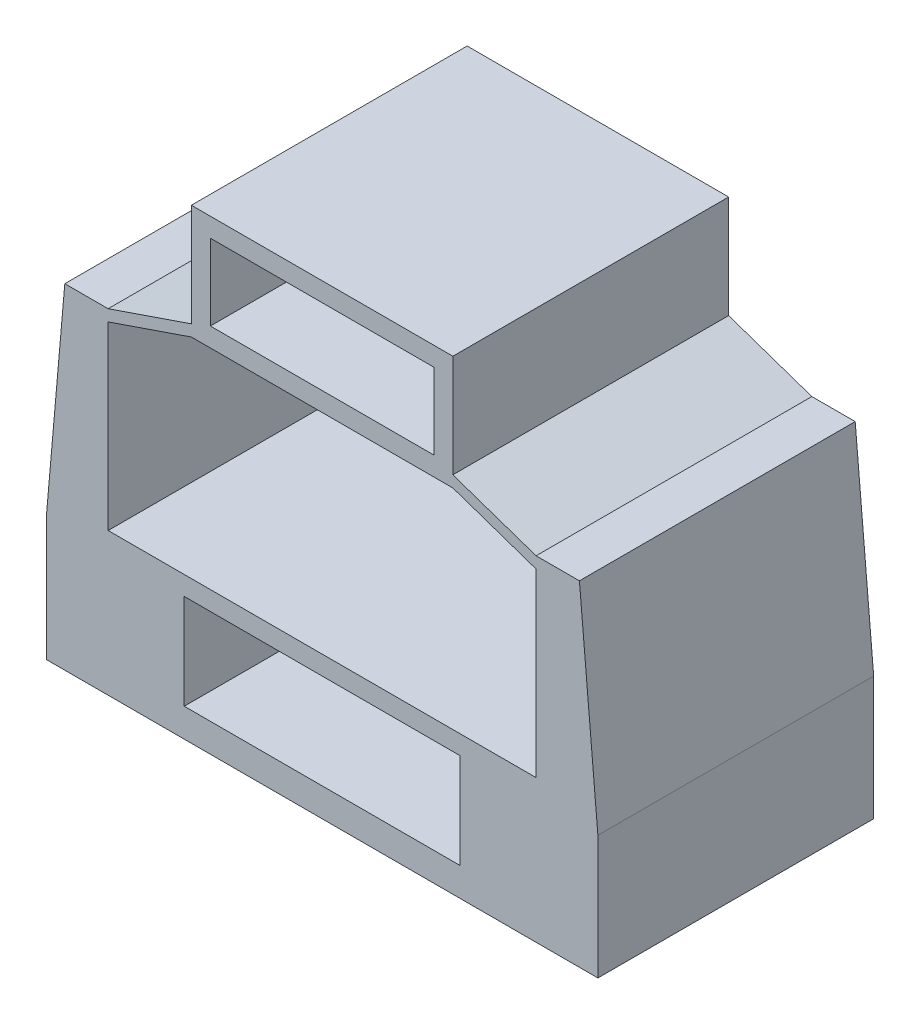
ISO-10303-21;
HEADER;
FILE_DESCRIPTION(('STEP AP214'),'2;1');
FILE_NAME('part.step','',(''),(''),'','','');
FILE_SCHEMA(('AUTOMOTIVE_DESIGN { 1 0 10303 214 1 1 1 1 }'));
ENDSEC;
DATA;
#1=APPLICATION_CONTEXT('core data for automotive mechanical design processes');
#2=APPLICATION_PROTOCOL_DEFINITION('international standard','automotive_design',2000,#1);
#3=PRODUCT_CONTEXT('',#1,'mechanical');
#4=PRODUCT('Part','Part','',(#3));
#5=PRODUCT_RELATED_PRODUCT_CATEGORY('part','',(#4));
#6=PRODUCT_DEFINITION_FORMATION('','',#4);
#7=PRODUCT_DEFINITION_CONTEXT('part definition',#1,'design');
#8=PRODUCT_DEFINITION('design','',#6,#7);
#9=PRODUCT_DEFINITION_SHAPE('','',#8);
#10=(LENGTH_UNIT() NAMED_UNIT(*) SI_UNIT(.MILLI.,.METRE.));
#11=(NAMED_UNIT(*) PLANE_ANGLE_UNIT() SI_UNIT($,.RADIAN.));
#12=(NAMED_UNIT(*) SI_UNIT($,.STERADIAN.) SOLID_ANGLE_UNIT());
#13=UNCERTAINTY_MEASURE_WITH_UNIT(LENGTH_MEASURE(1.E-05),#10,'distance_accuracy_value','');
#14=(GEOMETRIC_REPRESENTATION_CONTEXT(3) GLOBAL_UNCERTAINTY_ASSIGNED_CONTEXT((#13)) GLOBAL_UNIT_ASSIGNED_CONTEXT((#10,
#11,#12)) REPRESENTATION_CONTEXT('',''));
#15=CARTESIAN_POINT('',(0.,0.,0.));
#16=DIRECTION('',(0.,0.,1.));
#17=DIRECTION('',(1.,0.,0.));
#18=AXIS2_PLACEMENT_3D('',#15,#16,#17);
#19=CARTESIAN_POINT('',(-5.8,0.,5.8));
#20=DIRECTION('',(0.,1.,0.));
#21=DIRECTION('',(0.,0.,1.));
#22=AXIS2_PLACEMENT_3D('',#19,#20,#21);
#23=PLANE('',#22);
#24=DIRECTION('',(1.,0.,0.));
#25=VECTOR('',#24,1.);
#26=CARTESIAN_POINT('',(-5.8,0.,0.));
#27=LINE('',#26,#25);
#28=CARTESIAN_POINT('',(-5.8,0.,0.));
#29=VERTEX_POINT('',#28);
#30=CARTESIAN_POINT('',(5.8,0.,0.));
#31=VERTEX_POINT('',#30);
#32=EDGE_CURVE('E166',#29,#31,#27,.T.);
#33=ORIENTED_EDGE('',*,*,#32,.T.);
#34=DIRECTION('',(0.,0.,-1.));
#35=VECTOR('',#34,1.);
#36=CARTESIAN_POINT('',(5.8,0.,5.8));
#37=LINE('',#36,#35);
#38=CARTESIAN_POINT('',(5.8,0.,5.8));
#39=VERTEX_POINT('',#38);
#40=EDGE_CURVE('E170',#39,#31,#37,.T.);
#41=ORIENTED_EDGE('',*,*,#40,.F.);
#42=DIRECTION('',(1.,0.,0.));
#43=VECTOR('',#42,1.);
#44=CARTESIAN_POINT('',(-5.8,0.,5.8));
#45=LINE('',#44,#43);
#46=CARTESIAN_POINT('',(-5.8,0.,5.8));
#47=VERTEX_POINT('',#46);
#48=EDGE_CURVE('E202',#47,#39,#45,.T.);
#49=ORIENTED_EDGE('',*,*,#48,.F.);
#50=DIRECTION('',(0.,0.,-1.));
#51=VECTOR('',#50,1.);
#52=CARTESIAN_POINT('',(-5.8,0.,5.8));
#53=LINE('',#52,#51);
#54=EDGE_CURVE('E162',#47,#29,#53,.T.);
#55=ORIENTED_EDGE('',*,*,#54,.T.);
#56=EDGE_LOOP('',(#33,#41,#49,#55));
#57=FACE_BOUND('',#56,.T.);
#58=ADVANCED_FACE('F32',(#57),#23,.F.);
#59=CARTESIAN_POINT('',(0.,0.6,5.8));
#60=DIRECTION('',(0.,-1.,0.));
#61=DIRECTION('',(0.,0.,-1.));
#62=AXIS2_PLACEMENT_3D('',#59,#60,#61);
#63=PLANE('',#62);
#64=DIRECTION('',(-1.,0.,0.));
#65=VECTOR('',#64,1.);
#66=CARTESIAN_POINT('',(0.,0.6,0.));
#67=LINE('',#66,#65);
#68=CARTESIAN_POINT('',(2.9,0.6,0.));
#69=VERTEX_POINT('',#68);
#70=CARTESIAN_POINT('',(-2.9,0.6,0.));
#71=VERTEX_POINT('',#70);
#72=EDGE_CURVE('E169',#69,#71,#67,.T.);
#73=ORIENTED_EDGE('',*,*,#72,.T.);
#74=DIRECTION('',(0.,0.,-1.));
#75=VECTOR('',#74,1.);
#76=CARTESIAN_POINT('',(-2.9,0.6,5.8));
#77=LINE('',#76,#75);
#78=CARTESIAN_POINT('',(-2.9,0.6,5.8));
#79=VERTEX_POINT('',#78);
#80=EDGE_CURVE('E11',#79,#71,#77,.T.);
#81=ORIENTED_EDGE('',*,*,#80,.F.);
#82=DIRECTION('',(-1.,0.,0.));
#83=VECTOR('',#82,1.);
#84=CARTESIAN_POINT('',(0.,0.6,5.8));
#85=LINE('',#84,#83);
#86=CARTESIAN_POINT('',(2.9,0.6,5.8));
#87=VERTEX_POINT('',#86);
#88=EDGE_CURVE('E108',#87,#79,#85,.T.);
#89=ORIENTED_EDGE('',*,*,#88,.F.);
#90=DIRECTION('',(0.,0.,-1.));
#91=VECTOR('',#90,1.);
#92=CARTESIAN_POINT('',(2.9,0.6,5.8));
#93=LINE('',#92,#91);
#94=EDGE_CURVE('E261',#87,#69,#93,.T.);
#95=ORIENTED_EDGE('',*,*,#94,.T.);
#96=EDGE_LOOP('',(#73,#81,#89,#95));
#97=FACE_BOUND('',#96,.T.);
#98=ADVANCED_FACE('F479',(#97),#63,.F.);
#99=CARTESIAN_POINT('',(-2.9,0.6,5.8));
#100=DIRECTION('',(-1.,0.,0.));
#101=DIRECTION('',(0.,0.,1.));
#102=AXIS2_PLACEMENT_3D('',#99,#100,#101);
#103=PLANE('',#102);
#104=DIRECTION('',(0.,1.,0.));
#105=VECTOR('',#104,1.);
#106=CARTESIAN_POINT('',(-2.9,0.6,0.));
#107=LINE('',#106,#105);
#108=CARTESIAN_POINT('',(-2.9,2.6,0.));
#109=VERTEX_POINT('',#108);
#110=EDGE_CURVE('E172',#71,#109,#107,.T.);
#111=ORIENTED_EDGE('',*,*,#110,.T.);
#112=DIRECTION('',(0.,0.,-1.));
#113=VECTOR('',#112,1.);
#114=CARTESIAN_POINT('',(-2.9,2.6,5.8));
#115=LINE('',#114,#113);
#116=CARTESIAN_POINT('',(-2.9,2.6,5.8));
#117=VERTEX_POINT('',#116);
#118=EDGE_CURVE('E40',#117,#109,#115,.T.);
#119=ORIENTED_EDGE('',*,*,#118,.F.);
#120=DIRECTION('',(0.,1.,0.));
#121=VECTOR('',#120,1.);
#122=CARTESIAN_POINT('',(-2.9,0.6,5.8));
#123=LINE('',#122,#121);
#124=EDGE_CURVE('E300',#79,#117,#123,.T.);
#125=ORIENTED_EDGE('',*,*,#124,.F.);
#126=ORIENTED_EDGE('',*,*,#80,.T.);
#127=EDGE_LOOP('',(#111,#119,#125,#126));
#128=FACE_BOUND('',#127,.T.);
#129=ADVANCED_FACE('F483',(#128),#103,.F.);
#130=CARTESIAN_POINT('',(-2.9,2.6,5.8));
#131=DIRECTION('',(0.,1.,0.));
#132=DIRECTION('',(0.,0.,1.));
#133=AXIS2_PLACEMENT_3D('',#130,#131,#132);
#134=PLANE('',#133);
#135=DIRECTION('',(1.,0.,0.));
#136=VECTOR('',#135,1.);
#137=CARTESIAN_POINT('',(-2.9,2.6,0.));
#138=LINE('',#137,#136);
#139=CARTESIAN_POINT('',(2.9,2.6,0.));
#140=VERTEX_POINT('',#139);
#141=EDGE_CURVE('E174',#109,#140,#138,.T.);
#142=ORIENTED_EDGE('',*,*,#141,.T.);
#143=DIRECTION('',(0.,0.,-1.));
#144=VECTOR('',#143,1.);
#145=CARTESIAN_POINT('',(2.9,2.6,5.8));
#146=LINE('',#145,#144);
#147=CARTESIAN_POINT('',(2.9,2.6,5.8));
#148=VERTEX_POINT('',#147);
#149=EDGE_CURVE('E263',#148,#140,#146,.T.);
#150=ORIENTED_EDGE('',*,*,#149,.F.);
#151=DIRECTION('',(1.,0.,0.));
#152=VECTOR('',#151,1.);
#153=CARTESIAN_POINT('',(-2.9,2.6,5.8));
#154=LINE('',#153,#152);
#155=EDGE_CURVE('E236',#117,#148,#154,.T.);
#156=ORIENTED_EDGE('',*,*,#155,.F.);
#157=ORIENTED_EDGE('',*,*,#118,.T.);
#158=EDGE_LOOP('',(#142,#150,#156,#157));
#159=FACE_BOUND('',#158,.T.);
#160=ADVANCED_FACE('F231',(#159),#134,.F.);
#161=CARTESIAN_POINT('',(0.,3.,5.8));
#162=DIRECTION('',(0.,-1.,0.));
#163=DIRECTION('',(1.,0.,0.));
#164=AXIS2_PLACEMENT_3D('',#161,#162,#163);
#165=PLANE('',#164);
#166=DIRECTION('',(-1.,0.,0.));
#167=VECTOR('',#166,1.);
#168=CARTESIAN_POINT('',(0.,3.,0.));
#169=LINE('',#168,#167);
#170=CARTESIAN_POINT('',(4.5,3.,0.));
#171=VERTEX_POINT('',#170);
#172=CARTESIAN_POINT('',(-4.5,3.,0.));
#173=VERTEX_POINT('',#172);
#174=EDGE_CURVE('E177',#171,#173,#169,.T.);
#175=ORIENTED_EDGE('',*,*,#174,.T.);
#176=DIRECTION('',(0.,0.,-1.));
#177=VECTOR('',#176,1.);
#178=CARTESIAN_POINT('',(-4.5,3.,5.8));
#179=LINE('',#178,#177);
#180=CARTESIAN_POINT('',(-4.5,3.,5.8));
#181=VERTEX_POINT('',#180);
#182=EDGE_CURVE('E224',#181,#173,#179,.T.);
#183=ORIENTED_EDGE('',*,*,#182,.F.);
#184=DIRECTION('',(-1.,0.,0.));
#185=VECTOR('',#184,1.);
#186=CARTESIAN_POINT('',(0.,3.,5.8));
#187=LINE('',#186,#185);
#188=CARTESIAN_POINT('',(4.5,3.,5.8));
#189=VERTEX_POINT('',#188);
#190=EDGE_CURVE('E303',#189,#181,#187,.T.);
#191=ORIENTED_EDGE('',*,*,#190,.F.);
#192=DIRECTION('',(0.,0.,-1.));
#193=VECTOR('',#192,1.);
#194=CARTESIAN_POINT('',(4.5,3.,5.8));
#195=LINE('',#194,#193);
#196=EDGE_CURVE('E266',#189,#171,#195,.T.);
#197=ORIENTED_EDGE('',*,*,#196,.T.);
#198=EDGE_LOOP('',(#175,#183,#191,#197));
#199=FACE_BOUND('',#198,.T.);
#200=ADVANCED_FACE('F492',(#199),#165,.F.);
#201=CARTESIAN_POINT('',(-4.5,3.,5.8));
#202=DIRECTION('',(-1.,0.,0.));
#203=DIRECTION('',(0.,0.,1.));
#204=AXIS2_PLACEMENT_3D('',#201,#202,#203);
#205=PLANE('',#204);
#206=DIRECTION('',(0.,1.,0.));
#207=VECTOR('',#206,1.);
#208=CARTESIAN_POINT('',(-4.5,3.,0.));
#209=LINE('',#208,#207);
#210=CARTESIAN_POINT('',(-4.5,6.8,0.));
#211=VERTEX_POINT('',#210);
#212=EDGE_CURVE('E179',#173,#211,#209,.T.);
#213=ORIENTED_EDGE('',*,*,#212,.T.);
#214=DIRECTION('',(0.,0.,-1.));
#215=VECTOR('',#214,1.);
#216=CARTESIAN_POINT('',(-4.5,6.8,5.8));
#217=LINE('',#216,#215);
#218=CARTESIAN_POINT('',(-4.5,6.8,5.8));
#219=VERTEX_POINT('',#218);
#220=EDGE_CURVE('E221',#219,#211,#217,.T.);
#221=ORIENTED_EDGE('',*,*,#220,.F.);
#222=DIRECTION('',(0.,1.,0.));
#223=VECTOR('',#222,1.);
#224=CARTESIAN_POINT('',(-4.5,3.,5.8));
#225=LINE('',#224,#223);
#226=EDGE_CURVE('E305',#181,#219,#225,.T.);
#227=ORIENTED_EDGE('',*,*,#226,.F.);
#228=ORIENTED_EDGE('',*,*,#182,.T.);
#229=EDGE_LOOP('',(#213,#221,#227,#228));
#230=FACE_BOUND('',#229,.T.);
#231=ADVANCED_FACE('F495',(#230),#205,.F.);
#232=CARTESIAN_POINT('',(-4.5,6.8,5.8));
#233=DIRECTION('',(-0.324324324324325,0.945945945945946,0.));
#234=DIRECTION('',(-0.945945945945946,-0.324324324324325,0.));
#235=AXIS2_PLACEMENT_3D('',#232,#233,#234);
#236=PLANE('',#235);
#237=DIRECTION('',(0.945945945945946,0.324324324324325,0.));
#238=VECTOR('',#237,1.);
#239=CARTESIAN_POINT('',(-4.5,6.8,0.));
#240=LINE('',#239,#238);
#241=CARTESIAN_POINT('',(-2.75,7.4,0.));
#242=VERTEX_POINT('',#241);
#243=EDGE_CURVE('E181',#211,#242,#240,.T.);
#244=ORIENTED_EDGE('',*,*,#243,.T.);
#245=DIRECTION('',(0.,0.,-1.));
#246=VECTOR('',#245,1.);
#247=CARTESIAN_POINT('',(-2.75,7.4,5.8));
#248=LINE('',#247,#246);
#249=CARTESIAN_POINT('',(-2.75,7.4,5.8));
#250=VERTEX_POINT('',#249);
#251=EDGE_CURVE('E218',#250,#242,#248,.T.);
#252=ORIENTED_EDGE('',*,*,#251,.F.);
#253=DIRECTION('',(0.945945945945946,0.324324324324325,0.));
#254=VECTOR('',#253,1.);
#255=CARTESIAN_POINT('',(-4.5,6.8,5.8));
#256=LINE('',#255,#254);
#257=EDGE_CURVE('E307',#219,#250,#256,.T.);
#258=ORIENTED_EDGE('',*,*,#257,.F.);
#259=ORIENTED_EDGE('',*,*,#220,.T.);
#260=EDGE_LOOP('',(#244,#252,#258,#259));
#261=FACE_BOUND('',#260,.T.);
#262=ADVANCED_FACE('F499',(#261),#236,.F.);
#263=CARTESIAN_POINT('',(-2.75,7.4,5.8));
#264=DIRECTION('',(0.,1.,0.));
#265=DIRECTION('',(-1.,0.,0.));
#266=AXIS2_PLACEMENT_3D('',#263,#264,#265);
#267=PLANE('',#266);
#268=DIRECTION('',(1.,0.,0.));
#269=VECTOR('',#268,1.);
#270=CARTESIAN_POINT('',(-2.75,7.4,0.));
#271=LINE('',#270,#269);
#272=CARTESIAN_POINT('',(2.75,7.4,0.));
#273=VERTEX_POINT('',#272);
#274=EDGE_CURVE('E183',#242,#273,#271,.T.);
#275=ORIENTED_EDGE('',*,*,#274,.T.);
#276=DIRECTION('',(0.,0.,-1.));
#277=VECTOR('',#276,1.);
#278=CARTESIAN_POINT('',(2.75,7.4,5.8));
#279=LINE('',#278,#277);
#280=CARTESIAN_POINT('',(2.75,7.4,5.8));
#281=VERTEX_POINT('',#280);
#282=EDGE_CURVE('E272',#281,#273,#279,.T.);
#283=ORIENTED_EDGE('',*,*,#282,.F.);
#284=DIRECTION('',(1.,0.,0.));
#285=VECTOR('',#284,1.);
#286=CARTESIAN_POINT('',(-2.75,7.4,5.8));
#287=LINE('',#286,#285);
#288=EDGE_CURVE('E309',#250,#281,#287,.T.);
#289=ORIENTED_EDGE('',*,*,#288,.F.);
#290=ORIENTED_EDGE('',*,*,#251,.T.);
#291=EDGE_LOOP('',(#275,#283,#289,#290));
#292=FACE_BOUND('',#291,.T.);
#293=ADVANCED_FACE('F503',(#292),#267,.F.);
#294=CARTESIAN_POINT('',(0.,7.8,5.8));
#295=DIRECTION('',(0.,-1.,0.));
#296=DIRECTION('',(0.,0.,-1.));
#297=AXIS2_PLACEMENT_3D('',#294,#295,#296);
#298=PLANE('',#297);
#299=DIRECTION('',(-1.,0.,0.));
#300=VECTOR('',#299,1.);
#301=CARTESIAN_POINT('',(0.,7.8,0.));
#302=LINE('',#301,#300);
#303=CARTESIAN_POINT('',(2.35,7.8,0.));
#304=VERTEX_POINT('',#303);
#305=CARTESIAN_POINT('',(-2.35,7.8,0.));
#306=VERTEX_POINT('',#305);
#307=EDGE_CURVE('E186',#304,#306,#302,.T.);
#308=ORIENTED_EDGE('',*,*,#307,.T.);
#309=DIRECTION('',(0.,0.,-1.));
#310=VECTOR('',#309,1.);
#311=CARTESIAN_POINT('',(-2.35,7.8,5.8));
#312=LINE('',#311,#310);
#313=CARTESIAN_POINT('',(-2.35,7.8,5.8));
#314=VERTEX_POINT('',#313);
#315=EDGE_CURVE('E215',#314,#306,#312,.T.);
#316=ORIENTED_EDGE('',*,*,#315,.F.);
#317=DIRECTION('',(-1.,0.,0.));
#318=VECTOR('',#317,1.);
#319=CARTESIAN_POINT('',(0.,7.8,5.8));
#320=LINE('',#319,#318);
#321=CARTESIAN_POINT('',(2.35,7.8,5.8));
#322=VERTEX_POINT('',#321);
#323=EDGE_CURVE('E312',#322,#314,#320,.T.);
#324=ORIENTED_EDGE('',*,*,#323,.F.);
#325=DIRECTION('',(0.,0.,-1.));
#326=VECTOR('',#325,1.);
#327=CARTESIAN_POINT('',(2.35,7.8,5.8));
#328=LINE('',#327,#326);
#329=EDGE_CURVE('E275',#322,#304,#328,.T.);
#330=ORIENTED_EDGE('',*,*,#329,.T.);
#331=EDGE_LOOP('',(#308,#316,#324,#330));
#332=FACE_BOUND('',#331,.T.);
#333=ADVANCED_FACE('F507',(#332),#298,.F.);
#334=CARTESIAN_POINT('',(-2.35,7.8,5.8));
#335=DIRECTION('',(-1.,0.,0.));
#336=DIRECTION('',(0.,0.,1.));
#337=AXIS2_PLACEMENT_3D('',#334,#335,#336);
#338=PLANE('',#337);
#339=DIRECTION('',(0.,1.,0.));
#340=VECTOR('',#339,1.);
#341=CARTESIAN_POINT('',(-2.35,7.8,0.));
#342=LINE('',#341,#340);
#343=CARTESIAN_POINT('',(-2.35,9.4,0.));
#344=VERTEX_POINT('',#343);
#345=EDGE_CURVE('E188',#306,#344,#342,.T.);
#346=ORIENTED_EDGE('',*,*,#345,.T.);
#347=DIRECTION('',(0.,0.,-1.));
#348=VECTOR('',#347,1.);
#349=CARTESIAN_POINT('',(-2.35,9.4,5.8));
#350=LINE('',#349,#348);
#351=CARTESIAN_POINT('',(-2.35,9.4,5.8));
#352=VERTEX_POINT('',#351);
#353=EDGE_CURVE('E212',#352,#344,#350,.T.);
#354=ORIENTED_EDGE('',*,*,#353,.F.);
#355=DIRECTION('',(0.,1.,0.));
#356=VECTOR('',#355,1.);
#357=CARTESIAN_POINT('',(-2.35,7.8,5.8));
#358=LINE('',#357,#356);
#359=EDGE_CURVE('E314',#314,#352,#358,.T.);
#360=ORIENTED_EDGE('',*,*,#359,.F.);
#361=ORIENTED_EDGE('',*,*,#315,.T.);
#362=EDGE_LOOP('',(#346,#354,#360,#361));
#363=FACE_BOUND('',#362,.T.);
#364=ADVANCED_FACE('F475',(#363),#338,.F.);
#365=CARTESIAN_POINT('',(-2.35,9.4,5.8));
#366=DIRECTION('',(0.,1.,0.));
#367=DIRECTION('',(0.,0.,1.));
#368=AXIS2_PLACEMENT_3D('',#365,#366,#367);
#369=PLANE('',#368);
#370=DIRECTION('',(1.,0.,0.));
#371=VECTOR('',#370,1.);
#372=CARTESIAN_POINT('',(-2.35,9.4,0.));
#373=LINE('',#372,#371);
#374=CARTESIAN_POINT('',(2.35,9.4,0.));
#375=VERTEX_POINT('',#374);
#376=EDGE_CURVE('E190',#344,#375,#373,.T.);
#377=ORIENTED_EDGE('',*,*,#376,.T.);
#378=DIRECTION('',(0.,0.,-1.));
#379=VECTOR('',#378,1.);
#380=CARTESIAN_POINT('',(2.35,9.4,5.8));
#381=LINE('',#380,#379);
#382=CARTESIAN_POINT('',(2.35,9.4,5.8));
#383=VERTEX_POINT('',#382);
#384=EDGE_CURVE('E278',#383,#375,#381,.T.);
#385=ORIENTED_EDGE('',*,*,#384,.F.);
#386=DIRECTION('',(1.,0.,0.));
#387=VECTOR('',#386,1.);
#388=CARTESIAN_POINT('',(-2.35,9.4,5.8));
#389=LINE('',#388,#387);
#390=EDGE_CURVE('E316',#352,#383,#389,.T.);
#391=ORIENTED_EDGE('',*,*,#390,.F.);
#392=ORIENTED_EDGE('',*,*,#353,.T.);
#393=EDGE_LOOP('',(#377,#385,#391,#392));
#394=FACE_BOUND('',#393,.T.);
#395=ADVANCED_FACE('F468',(#394),#369,.F.);
#396=CARTESIAN_POINT('',(0.,9.8,5.8));
#397=DIRECTION('',(0.,-1.,0.));
#398=DIRECTION('',(0.,0.,-1.));
#399=AXIS2_PLACEMENT_3D('',#396,#397,#398);
#400=PLANE('',#399);
#401=DIRECTION('',(-1.,0.,0.));
#402=VECTOR('',#401,1.);
#403=CARTESIAN_POINT('',(0.,9.8,0.));
#404=LINE('',#403,#402);
#405=CARTESIAN_POINT('',(2.75,9.8,0.));
#406=VERTEX_POINT('',#405);
#407=CARTESIAN_POINT('',(-2.75,9.8,0.));
#408=VERTEX_POINT('',#407);
#409=EDGE_CURVE('E193',#406,#408,#404,.T.);
#410=ORIENTED_EDGE('',*,*,#409,.T.);
#411=DIRECTION('',(0.,0.,-1.));
#412=VECTOR('',#411,1.);
#413=CARTESIAN_POINT('',(-2.75,9.8,5.8));
#414=LINE('',#413,#412);
#415=CARTESIAN_POINT('',(-2.75,9.8,5.8));
#416=VERTEX_POINT('',#415);
#417=EDGE_CURVE('E209',#416,#408,#414,.T.);
#418=ORIENTED_EDGE('',*,*,#417,.F.);
#419=DIRECTION('',(-1.,0.,0.));
#420=VECTOR('',#419,1.);
#421=CARTESIAN_POINT('',(0.,9.8,5.8));
#422=LINE('',#421,#420);
#423=CARTESIAN_POINT('',(2.75,9.8,5.8));
#424=VERTEX_POINT('',#423);
#425=EDGE_CURVE('E319',#424,#416,#422,.T.);
#426=ORIENTED_EDGE('',*,*,#425,.F.);
#427=DIRECTION('',(0.,0.,-1.));
#428=VECTOR('',#427,1.);
#429=CARTESIAN_POINT('',(2.75,9.8,5.8));
#430=LINE('',#429,#428);
#431=EDGE_CURVE('E281',#424,#406,#430,.T.);
#432=ORIENTED_EDGE('',*,*,#431,.T.);
#433=EDGE_LOOP('',(#410,#418,#426,#432));
#434=FACE_BOUND('',#433,.T.);
#435=ADVANCED_FACE('F466',(#434),#400,.F.);
#436=CARTESIAN_POINT('',(-2.75,9.8,5.8));
#437=DIRECTION('',(1.,0.,0.));
#438=DIRECTION('',(0.,1.,0.));
#439=AXIS2_PLACEMENT_3D('',#436,#437,#438);
#440=PLANE('',#439);
#441=DIRECTION('',(0.,-1.,0.));
#442=VECTOR('',#441,1.);
#443=CARTESIAN_POINT('',(-2.75,9.8,0.));
#444=LINE('',#443,#442);
#445=CARTESIAN_POINT('',(-2.75,7.64,0.));
#446=VERTEX_POINT('',#445);
#447=EDGE_CURVE('E195',#408,#446,#444,.T.);
#448=ORIENTED_EDGE('',*,*,#447,.T.);
#449=DIRECTION('',(0.,0.,-1.));
#450=VECTOR('',#449,1.);
#451=CARTESIAN_POINT('',(-2.75,7.64,5.8));
#452=LINE('',#451,#450);
#453=CARTESIAN_POINT('',(-2.75,7.64,5.8));
#454=VERTEX_POINT('',#453);
#455=EDGE_CURVE('E206',#454,#446,#452,.T.);
#456=ORIENTED_EDGE('',*,*,#455,.F.);
#457=DIRECTION('',(0.,-1.,0.));
#458=VECTOR('',#457,1.);
#459=CARTESIAN_POINT('',(-2.75,9.8,5.8));
#460=LINE('',#459,#458);
#461=EDGE_CURVE('E321',#416,#454,#460,.T.);
#462=ORIENTED_EDGE('',*,*,#461,.F.);
#463=ORIENTED_EDGE('',*,*,#417,.T.);
#464=EDGE_LOOP('',(#448,#456,#462,#463));
#465=FACE_BOUND('',#464,.T.);
#466=ADVANCED_FACE('F327',(#465),#440,.F.);
#467=CARTESIAN_POINT('',(-2.75,7.64,5.8));
#468=DIRECTION('',(0.324324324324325,-0.945945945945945,0.));
#469=DIRECTION('',(0.945945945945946,0.324324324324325,0.));
#470=AXIS2_PLACEMENT_3D('',#467,#468,#469);
#471=PLANE('',#470);
#472=DIRECTION('',(-0.945945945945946,-0.324324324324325,0.));
#473=VECTOR('',#472,1.);
#474=CARTESIAN_POINT('',(-2.75,7.64,0.));
#475=LINE('',#474,#473);
#476=CARTESIAN_POINT('',(-4.5,7.04,0.));
#477=VERTEX_POINT('',#476);
#478=EDGE_CURVE('E197',#446,#477,#475,.T.);
#479=ORIENTED_EDGE('',*,*,#478,.T.);
#480=DIRECTION('',(0.,0.,-1.));
#481=VECTOR('',#480,1.);
#482=CARTESIAN_POINT('',(-4.5,7.04,5.8));
#483=LINE('',#482,#481);
#484=CARTESIAN_POINT('',(-4.5,7.04,5.8));
#485=VERTEX_POINT('',#484);
#486=EDGE_CURVE('E157',#485,#477,#483,.T.);
#487=ORIENTED_EDGE('',*,*,#486,.F.);
#488=DIRECTION('',(-0.945945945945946,-0.324324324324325,0.));
#489=VECTOR('',#488,1.);
#490=CARTESIAN_POINT('',(-2.75,7.64,5.8));
#491=LINE('',#490,#489);
#492=EDGE_CURVE('E148',#454,#485,#491,.T.);
#493=ORIENTED_EDGE('',*,*,#492,.F.);
#494=ORIENTED_EDGE('',*,*,#455,.T.);
#495=EDGE_LOOP('',(#479,#487,#493,#494));
#496=FACE_BOUND('',#495,.T.);
#497=ADVANCED_FACE('F331',(#496),#471,.F.);
#498=CARTESIAN_POINT('',(-4.5,7.04,5.8));
#499=DIRECTION('',(0.,-1.,0.));
#500=DIRECTION('',(1.,0.,0.));
#501=AXIS2_PLACEMENT_3D('',#498,#499,#500);
#502=PLANE('',#501);
#503=DIRECTION('',(-1.,0.,0.));
#504=VECTOR('',#503,1.);
#505=CARTESIAN_POINT('',(-4.5,7.04,0.));
#506=LINE('',#505,#504);
#507=CARTESIAN_POINT('',(-5.41155033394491,7.04,0.));
#508=VERTEX_POINT('',#507);
#509=EDGE_CURVE('E156',#477,#508,#506,.T.);
#510=ORIENTED_EDGE('',*,*,#509,.T.);
#511=DIRECTION('',(0.,0.,-1.));
#512=VECTOR('',#511,1.);
#513=CARTESIAN_POINT('',(-5.41155033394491,7.04,5.8));
#514=LINE('',#513,#512);
#515=CARTESIAN_POINT('',(-5.41155033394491,7.04,5.8));
#516=VERTEX_POINT('',#515);
#517=EDGE_CURVE('E153',#516,#508,#514,.T.);
#518=ORIENTED_EDGE('',*,*,#517,.F.);
#519=DIRECTION('',(-1.,0.,0.));
#520=VECTOR('',#519,1.);
#521=CARTESIAN_POINT('',(-4.5,7.04,5.8));
#522=LINE('',#521,#520);
#523=EDGE_CURVE('E140',#485,#516,#522,.T.);
#524=ORIENTED_EDGE('',*,*,#523,.F.);
#525=ORIENTED_EDGE('',*,*,#486,.T.);
#526=EDGE_LOOP('',(#510,#518,#524,#525));
#527=FACE_BOUND('',#526,.T.);
#528=ADVANCED_FACE('F154',(#527),#502,.F.);
#529=CARTESIAN_POINT('',(-5.41155033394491,7.04,5.8));
#530=DIRECTION('',(0.996194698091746,-0.0871557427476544,0.));
#531=DIRECTION('',(0.0871557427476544,0.996194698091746,0.));
#532=AXIS2_PLACEMENT_3D('',#529,#530,#531);
#533=PLANE('',#532);
#534=DIRECTION('',(-0.0871557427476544,-0.996194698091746,0.));
#535=VECTOR('',#534,1.);
#536=CARTESIAN_POINT('',(-5.41155033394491,7.04,0.));
#537=LINE('',#536,#535);
#538=CARTESIAN_POINT('',(-5.8,2.6,0.));
#539=VERTEX_POINT('',#538);
#540=EDGE_CURVE('E93',#508,#539,#537,.T.);
#541=ORIENTED_EDGE('',*,*,#540,.T.);
#542=DIRECTION('',(0.,0.,-1.));
#543=VECTOR('',#542,1.);
#544=CARTESIAN_POINT('',(-5.8,2.6,5.8));
#545=LINE('',#544,#543);
#546=CARTESIAN_POINT('',(-5.8,2.6,5.8));
#547=VERTEX_POINT('',#546);
#548=EDGE_CURVE('E158',#547,#539,#545,.T.);
#549=ORIENTED_EDGE('',*,*,#548,.F.);
#550=DIRECTION('',(-0.0871557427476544,-0.996194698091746,0.));
#551=VECTOR('',#550,1.);
#552=CARTESIAN_POINT('',(-5.41155033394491,7.04,5.8));
#553=LINE('',#552,#551);
#554=EDGE_CURVE('E146',#516,#547,#553,.T.);
#555=ORIENTED_EDGE('',*,*,#554,.F.);
#556=ORIENTED_EDGE('',*,*,#517,.T.);
#557=EDGE_LOOP('',(#541,#549,#555,#556));
#558=FACE_BOUND('',#557,.T.);
#559=ADVANCED_FACE('F160',(#558),#533,.F.);
#560=CARTESIAN_POINT('',(-5.8,2.6,5.8));
#561=DIRECTION('',(1.,0.,0.));
#562=DIRECTION('',(0.,0.,-1.));
#563=AXIS2_PLACEMENT_3D('',#560,#561,#562);
#564=PLANE('',#563);
#565=DIRECTION('',(0.,-1.,0.));
#566=VECTOR('',#565,1.);
#567=CARTESIAN_POINT('',(-5.8,2.6,0.));
#568=LINE('',#567,#566);
#569=EDGE_CURVE('E99',#539,#29,#568,.T.);
#570=ORIENTED_EDGE('',*,*,#569,.T.);
#571=ORIENTED_EDGE('',*,*,#54,.F.);
#572=DIRECTION('',(0.,-1.,0.));
#573=VECTOR('',#572,1.);
#574=CARTESIAN_POINT('',(-5.8,2.6,5.8));
#575=LINE('',#574,#573);
#576=EDGE_CURVE('E48',#547,#47,#575,.T.);
#577=ORIENTED_EDGE('',*,*,#576,.F.);
#578=ORIENTED_EDGE('',*,*,#548,.T.);
#579=EDGE_LOOP('',(#570,#571,#577,#578));
#580=FACE_BOUND('',#579,.T.);
#581=ADVANCED_FACE('F530',(#580),#564,.F.);
#582=CARTESIAN_POINT('',(0.,0.,5.8));
#583=DIRECTION('',(0.,0.,1.));
#584=DIRECTION('',(1.,0.,0.));
#585=AXIS2_PLACEMENT_3D('',#582,#583,#584);
#586=PLANE('',#585);
#587=DIRECTION('',(0.,-1.,0.));
#588=VECTOR('',#587,1.);
#589=CARTESIAN_POINT('',(2.75,9.8,5.8));
#590=LINE('',#589,#588);
#591=CARTESIAN_POINT('',(2.75,7.64,5.8));
#592=VERTEX_POINT('',#591);
#593=EDGE_CURVE('E370',#424,#592,#590,.T.);
#594=ORIENTED_EDGE('',*,*,#593,.F.);
#595=ORIENTED_EDGE('',*,*,#425,.T.);
#596=ORIENTED_EDGE('',*,*,#461,.T.);
#597=ORIENTED_EDGE('',*,*,#492,.T.);
#598=ORIENTED_EDGE('',*,*,#523,.T.);
#599=ORIENTED_EDGE('',*,*,#554,.T.);
#600=ORIENTED_EDGE('',*,*,#576,.T.);
#601=ORIENTED_EDGE('',*,*,#48,.T.);
#602=DIRECTION('',(0.,-1.,0.));
#603=VECTOR('',#602,1.);
#604=CARTESIAN_POINT('',(5.8,2.6,5.8));
#605=LINE('',#604,#603);
#606=CARTESIAN_POINT('',(5.8,2.6,5.8));
#607=VERTEX_POINT('',#606);
#608=EDGE_CURVE('E250',#607,#39,#605,.T.);
#609=ORIENTED_EDGE('',*,*,#608,.F.);
#610=DIRECTION('',(0.0871557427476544,-0.996194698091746,0.));
#611=VECTOR('',#610,1.);
#612=CARTESIAN_POINT('',(5.41155033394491,7.04,5.8));
#613=LINE('',#612,#611);
#614=CARTESIAN_POINT('',(5.41155033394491,7.04,5.8));
#615=VERTEX_POINT('',#614);
#616=EDGE_CURVE('E254',#615,#607,#613,.T.);
#617=ORIENTED_EDGE('',*,*,#616,.F.);
#618=DIRECTION('',(1.,0.,0.));
#619=VECTOR('',#618,1.);
#620=CARTESIAN_POINT('',(4.5,7.04,5.8));
#621=LINE('',#620,#619);
#622=CARTESIAN_POINT('',(4.5,7.04,5.8));
#623=VERTEX_POINT('',#622);
#624=EDGE_CURVE('E363',#623,#615,#621,.T.);
#625=ORIENTED_EDGE('',*,*,#624,.F.);
#626=DIRECTION('',(0.945945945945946,-0.324324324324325,0.));
#627=VECTOR('',#626,1.);
#628=CARTESIAN_POINT('',(2.75,7.64,5.8));
#629=LINE('',#628,#627);
#630=EDGE_CURVE('E365',#592,#623,#629,.T.);
#631=ORIENTED_EDGE('',*,*,#630,.F.);
#632=EDGE_LOOP('',(#594,#595,#596,#597,#598,#599,#600,#601,#609,#617,#625,#631));
#633=FACE_BOUND('',#632,.T.);
#634=DIRECTION('',(0.,1.,0.));
#635=VECTOR('',#634,1.);
#636=CARTESIAN_POINT('',(2.35,7.8,5.8));
#637=LINE('',#636,#635);
#638=EDGE_CURVE('E373',#322,#383,#637,.T.);
#639=ORIENTED_EDGE('',*,*,#638,.F.);
#640=ORIENTED_EDGE('',*,*,#323,.T.);
#641=ORIENTED_EDGE('',*,*,#359,.T.);
#642=ORIENTED_EDGE('',*,*,#390,.T.);
#643=EDGE_LOOP('',(#639,#640,#641,#642));
#644=FACE_BOUND('',#643,.T.);
#645=DIRECTION('',(0.,1.,0.));
#646=VECTOR('',#645,1.);
#647=CARTESIAN_POINT('',(4.5,3.,5.8));
#648=LINE('',#647,#646);
#649=CARTESIAN_POINT('',(4.5,6.8,5.8));
#650=VERTEX_POINT('',#649);
#651=EDGE_CURVE('E379',#189,#650,#648,.T.);
#652=ORIENTED_EDGE('',*,*,#651,.F.);
#653=ORIENTED_EDGE('',*,*,#190,.T.);
#654=ORIENTED_EDGE('',*,*,#226,.T.);
#655=ORIENTED_EDGE('',*,*,#257,.T.);
#656=ORIENTED_EDGE('',*,*,#288,.T.);
#657=DIRECTION('',(-0.945945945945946,0.324324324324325,0.));
#658=VECTOR('',#657,1.);
#659=CARTESIAN_POINT('',(4.5,6.8,5.8));
#660=LINE('',#659,#658);
#661=EDGE_CURVE('E376',#650,#281,#660,.T.);
#662=ORIENTED_EDGE('',*,*,#661,.F.);
#663=EDGE_LOOP('',(#652,#653,#654,#655,#656,#662));
#664=FACE_BOUND('',#663,.T.);
#665=ORIENTED_EDGE('',*,*,#155,.T.);
#666=DIRECTION('',(0.,1.,0.));
#667=VECTOR('',#666,1.);
#668=CARTESIAN_POINT('',(2.9,0.6,5.8));
#669=LINE('',#668,#667);
#670=EDGE_CURVE('E264',#87,#148,#669,.T.);
#671=ORIENTED_EDGE('',*,*,#670,.F.);
#672=ORIENTED_EDGE('',*,*,#88,.T.);
#673=ORIENTED_EDGE('',*,*,#124,.T.);
#674=EDGE_LOOP('',(#665,#671,#672,#673));
#675=FACE_BOUND('',#674,.T.);
#676=ADVANCED_FACE('F143',(#633,#644,#664,#675),#586,.T.);
#677=CARTESIAN_POINT('',(0.,0.,0.));
#678=DIRECTION('',(0.,0.,1.));
#679=DIRECTION('',(1.,0.,0.));
#680=AXIS2_PLACEMENT_3D('',#677,#678,#679);
#681=PLANE('',#680);
#682=ORIENTED_EDGE('',*,*,#409,.F.);
#683=DIRECTION('',(0.,-1.,0.));
#684=VECTOR('',#683,1.);
#685=CARTESIAN_POINT('',(2.75,9.8,0.));
#686=LINE('',#685,#684);
#687=CARTESIAN_POINT('',(2.75,7.64,0.));
#688=VERTEX_POINT('',#687);
#689=EDGE_CURVE('E393',#406,#688,#686,.T.);
#690=ORIENTED_EDGE('',*,*,#689,.T.);
#691=DIRECTION('',(0.945945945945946,-0.324324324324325,0.));
#692=VECTOR('',#691,1.);
#693=CARTESIAN_POINT('',(2.75,7.64,0.));
#694=LINE('',#693,#692);
#695=CARTESIAN_POINT('',(4.5,7.04,0.));
#696=VERTEX_POINT('',#695);
#697=EDGE_CURVE('E390',#688,#696,#694,.T.);
#698=ORIENTED_EDGE('',*,*,#697,.T.);
#699=DIRECTION('',(1.,0.,0.));
#700=VECTOR('',#699,1.);
#701=CARTESIAN_POINT('',(4.5,7.04,0.));
#702=LINE('',#701,#700);
#703=CARTESIAN_POINT('',(5.41155033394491,7.04,0.));
#704=VERTEX_POINT('',#703);
#705=EDGE_CURVE('E387',#696,#704,#702,.T.);
#706=ORIENTED_EDGE('',*,*,#705,.T.);
#707=DIRECTION('',(0.0871557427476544,-0.996194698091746,0.));
#708=VECTOR('',#707,1.);
#709=CARTESIAN_POINT('',(5.41155033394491,7.04,0.));
#710=LINE('',#709,#708);
#711=CARTESIAN_POINT('',(5.8,2.6,0.));
#712=VERTEX_POINT('',#711);
#713=EDGE_CURVE('E385',#704,#712,#710,.T.);
#714=ORIENTED_EDGE('',*,*,#713,.T.);
#715=DIRECTION('',(0.,-1.,0.));
#716=VECTOR('',#715,1.);
#717=CARTESIAN_POINT('',(5.8,2.6,0.));
#718=LINE('',#717,#716);
#719=EDGE_CURVE('E340',#712,#31,#718,.T.);
#720=ORIENTED_EDGE('',*,*,#719,.T.);
#721=ORIENTED_EDGE('',*,*,#32,.F.);
#722=ORIENTED_EDGE('',*,*,#569,.F.);
#723=ORIENTED_EDGE('',*,*,#540,.F.);
#724=ORIENTED_EDGE('',*,*,#509,.F.);
#725=ORIENTED_EDGE('',*,*,#478,.F.);
#726=ORIENTED_EDGE('',*,*,#447,.F.);
#727=EDGE_LOOP('',(#682,#690,#698,#706,#714,#720,#721,#722,#723,#724,#725,#726));
#728=FACE_BOUND('',#727,.T.);
#729=ORIENTED_EDGE('',*,*,#307,.F.);
#730=DIRECTION('',(0.,1.,0.));
#731=VECTOR('',#730,1.);
#732=CARTESIAN_POINT('',(2.35,7.8,0.));
#733=LINE('',#732,#731);
#734=EDGE_CURVE('E396',#304,#375,#733,.T.);
#735=ORIENTED_EDGE('',*,*,#734,.T.);
#736=ORIENTED_EDGE('',*,*,#376,.F.);
#737=ORIENTED_EDGE('',*,*,#345,.F.);
#738=EDGE_LOOP('',(#729,#735,#736,#737));
#739=FACE_BOUND('',#738,.T.);
#740=ORIENTED_EDGE('',*,*,#174,.F.);
#741=DIRECTION('',(0.,1.,0.));
#742=VECTOR('',#741,1.);
#743=CARTESIAN_POINT('',(4.5,3.,0.));
#744=LINE('',#743,#742);
#745=CARTESIAN_POINT('',(4.5,6.8,0.));
#746=VERTEX_POINT('',#745);
#747=EDGE_CURVE('E251',#171,#746,#744,.T.);
#748=ORIENTED_EDGE('',*,*,#747,.T.);
#749=DIRECTION('',(-0.945945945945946,0.324324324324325,0.));
#750=VECTOR('',#749,1.);
#751=CARTESIAN_POINT('',(4.5,6.8,0.));
#752=LINE('',#751,#750);
#753=EDGE_CURVE('E257',#746,#273,#752,.T.);
#754=ORIENTED_EDGE('',*,*,#753,.T.);
#755=ORIENTED_EDGE('',*,*,#274,.F.);
#756=ORIENTED_EDGE('',*,*,#243,.F.);
#757=ORIENTED_EDGE('',*,*,#212,.F.);
#758=EDGE_LOOP('',(#740,#748,#754,#755,#756,#757));
#759=FACE_BOUND('',#758,.T.);
#760=DIRECTION('',(0.,1.,0.));
#761=VECTOR('',#760,1.);
#762=CARTESIAN_POINT('',(2.9,0.6,0.));
#763=LINE('',#762,#761);
#764=EDGE_CURVE('E245',#69,#140,#763,.T.);
#765=ORIENTED_EDGE('',*,*,#764,.T.);
#766=ORIENTED_EDGE('',*,*,#141,.F.);
#767=ORIENTED_EDGE('',*,*,#110,.F.);
#768=ORIENTED_EDGE('',*,*,#72,.F.);
#769=EDGE_LOOP('',(#765,#766,#767,#768));
#770=FACE_BOUND('',#769,.T.);
#771=ADVANCED_FACE('F242',(#728,#739,#759,#770),#681,.F.);
#772=CARTESIAN_POINT('',(5.8,2.6,5.8));
#773=DIRECTION('',(1.,0.,0.));
#774=DIRECTION('',(0.,0.,-1.));
#775=AXIS2_PLACEMENT_3D('',#772,#773,#774);
#776=PLANE('',#775);
#777=ORIENTED_EDGE('',*,*,#719,.F.);
#778=DIRECTION('',(0.,0.,-1.));
#779=VECTOR('',#778,1.);
#780=CARTESIAN_POINT('',(5.8,2.6,5.8));
#781=LINE('',#780,#779);
#782=EDGE_CURVE('E293',#607,#712,#781,.T.);
#783=ORIENTED_EDGE('',*,*,#782,.F.);
#784=ORIENTED_EDGE('',*,*,#608,.T.);
#785=ORIENTED_EDGE('',*,*,#40,.T.);
#786=EDGE_LOOP('',(#777,#783,#784,#785));
#787=FACE_BOUND('',#786,.T.);
#788=ADVANCED_FACE('F348',(#787),#776,.T.);
#789=CARTESIAN_POINT('',(5.41155033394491,7.04,5.8));
#790=DIRECTION('',(0.996194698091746,0.0871557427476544,0.));
#791=DIRECTION('',(-0.0871557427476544,0.996194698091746,0.));
#792=AXIS2_PLACEMENT_3D('',#789,#790,#791);
#793=PLANE('',#792);
#794=ORIENTED_EDGE('',*,*,#713,.F.);
#795=DIRECTION('',(0.,0.,-1.));
#796=VECTOR('',#795,1.);
#797=CARTESIAN_POINT('',(5.41155033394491,7.04,5.8));
#798=LINE('',#797,#796);
#799=EDGE_CURVE('E290',#615,#704,#798,.T.);
#800=ORIENTED_EDGE('',*,*,#799,.F.);
#801=ORIENTED_EDGE('',*,*,#616,.T.);
#802=ORIENTED_EDGE('',*,*,#782,.T.);
#803=EDGE_LOOP('',(#794,#800,#801,#802));
#804=FACE_BOUND('',#803,.T.);
#805=ADVANCED_FACE('F362',(#804),#793,.T.);
#806=CARTESIAN_POINT('',(4.5,7.04,5.8));
#807=DIRECTION('',(0.,1.,0.));
#808=DIRECTION('',(-1.,0.,0.));
#809=AXIS2_PLACEMENT_3D('',#806,#807,#808);
#810=PLANE('',#809);
#811=ORIENTED_EDGE('',*,*,#705,.F.);
#812=DIRECTION('',(0.,0.,-1.));
#813=VECTOR('',#812,1.);
#814=CARTESIAN_POINT('',(4.5,7.04,5.8));
#815=LINE('',#814,#813);
#816=EDGE_CURVE('E287',#623,#696,#815,.T.);
#817=ORIENTED_EDGE('',*,*,#816,.F.);
#818=ORIENTED_EDGE('',*,*,#624,.T.);
#819=ORIENTED_EDGE('',*,*,#799,.T.);
#820=EDGE_LOOP('',(#811,#817,#818,#819));
#821=FACE_BOUND('',#820,.T.);
#822=ADVANCED_FACE('F456',(#821),#810,.T.);
#823=CARTESIAN_POINT('',(2.75,7.64,5.8));
#824=DIRECTION('',(0.324324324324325,0.945945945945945,0.));
#825=DIRECTION('',(-0.945945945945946,0.324324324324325,0.));
#826=AXIS2_PLACEMENT_3D('',#823,#824,#825);
#827=PLANE('',#826);
#828=ORIENTED_EDGE('',*,*,#697,.F.);
#829=DIRECTION('',(0.,0.,-1.));
#830=VECTOR('',#829,1.);
#831=CARTESIAN_POINT('',(2.75,7.64,5.8));
#832=LINE('',#831,#830);
#833=EDGE_CURVE('E284',#592,#688,#832,.T.);
#834=ORIENTED_EDGE('',*,*,#833,.F.);
#835=ORIENTED_EDGE('',*,*,#630,.T.);
#836=ORIENTED_EDGE('',*,*,#816,.T.);
#837=EDGE_LOOP('',(#828,#834,#835,#836));
#838=FACE_BOUND('',#837,.T.);
#839=ADVANCED_FACE('F460',(#838),#827,.T.);
#840=CARTESIAN_POINT('',(2.75,9.8,5.8));
#841=DIRECTION('',(1.,0.,0.));
#842=DIRECTION('',(0.,1.,0.));
#843=AXIS2_PLACEMENT_3D('',#840,#841,#842);
#844=PLANE('',#843);
#845=ORIENTED_EDGE('',*,*,#689,.F.);
#846=ORIENTED_EDGE('',*,*,#431,.F.);
#847=ORIENTED_EDGE('',*,*,#593,.T.);
#848=ORIENTED_EDGE('',*,*,#833,.T.);
#849=EDGE_LOOP('',(#845,#846,#847,#848));
#850=FACE_BOUND('',#849,.T.);
#851=ADVANCED_FACE('F463',(#850),#844,.T.);
#852=CARTESIAN_POINT('',(2.35,7.8,5.8));
#853=DIRECTION('',(-1.,0.,0.));
#854=DIRECTION('',(0.,0.,1.));
#855=AXIS2_PLACEMENT_3D('',#852,#853,#854);
#856=PLANE('',#855);
#857=ORIENTED_EDGE('',*,*,#734,.F.);
#858=ORIENTED_EDGE('',*,*,#329,.F.);
#859=ORIENTED_EDGE('',*,*,#638,.T.);
#860=ORIENTED_EDGE('',*,*,#384,.T.);
#861=EDGE_LOOP('',(#857,#858,#859,#860));
#862=FACE_BOUND('',#861,.T.);
#863=ADVANCED_FACE('F526',(#862),#856,.T.);
#864=CARTESIAN_POINT('',(4.5,6.8,5.8));
#865=DIRECTION('',(-0.324324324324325,-0.945945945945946,0.));
#866=DIRECTION('',(0.945945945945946,-0.324324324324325,0.));
#867=AXIS2_PLACEMENT_3D('',#864,#865,#866);
#868=PLANE('',#867);
#869=ORIENTED_EDGE('',*,*,#753,.F.);
#870=DIRECTION('',(0.,0.,-1.));
#871=VECTOR('',#870,1.);
#872=CARTESIAN_POINT('',(4.5,6.8,5.8));
#873=LINE('',#872,#871);
#874=EDGE_CURVE('E269',#650,#746,#873,.T.);
#875=ORIENTED_EDGE('',*,*,#874,.F.);
#876=ORIENTED_EDGE('',*,*,#661,.T.);
#877=ORIENTED_EDGE('',*,*,#282,.T.);
#878=EDGE_LOOP('',(#869,#875,#876,#877));
#879=FACE_BOUND('',#878,.T.);
#880=ADVANCED_FACE('F411',(#879),#868,.T.);
#881=CARTESIAN_POINT('',(4.5,3.,5.8));
#882=DIRECTION('',(-1.,0.,0.));
#883=DIRECTION('',(0.,0.,1.));
#884=AXIS2_PLACEMENT_3D('',#881,#882,#883);
#885=PLANE('',#884);
#886=ORIENTED_EDGE('',*,*,#747,.F.);
#887=ORIENTED_EDGE('',*,*,#196,.F.);
#888=ORIENTED_EDGE('',*,*,#651,.T.);
#889=ORIENTED_EDGE('',*,*,#874,.T.);
#890=EDGE_LOOP('',(#886,#887,#888,#889));
#891=FACE_BOUND('',#890,.T.);
#892=ADVANCED_FACE('F535',(#891),#885,.T.);
#893=CARTESIAN_POINT('',(2.9,0.6,5.8));
#894=DIRECTION('',(-1.,0.,0.));
#895=DIRECTION('',(0.,0.,1.));
#896=AXIS2_PLACEMENT_3D('',#893,#894,#895);
#897=PLANE('',#896);
#898=ORIENTED_EDGE('',*,*,#764,.F.);
#899=ORIENTED_EDGE('',*,*,#94,.F.);
#900=ORIENTED_EDGE('',*,*,#670,.T.);
#901=ORIENTED_EDGE('',*,*,#149,.T.);
#902=EDGE_LOOP('',(#898,#899,#900,#901));
#903=FACE_BOUND('',#902,.T.);
#904=ADVANCED_FACE('F533',(#903),#897,.T.);
#905=CLOSED_SHELL('',(#58,#98,#129,#160,#200,#231,#262,#293,#333,#364,#395,#435,#466,#497,#528,
#559,#581,#676,#771,#788,#805,#822,#839,#851,#863,#880,#892,#904));
#906=MANIFOLD_SOLID_BREP('B2',#905);
#907=ADVANCED_BREP_SHAPE_REPRESENTATION('',(#18,#906),#14);
#908=SHAPE_DEFINITION_REPRESENTATION(#9,#907);
ENDSEC;
END-ISO-10303-21;
